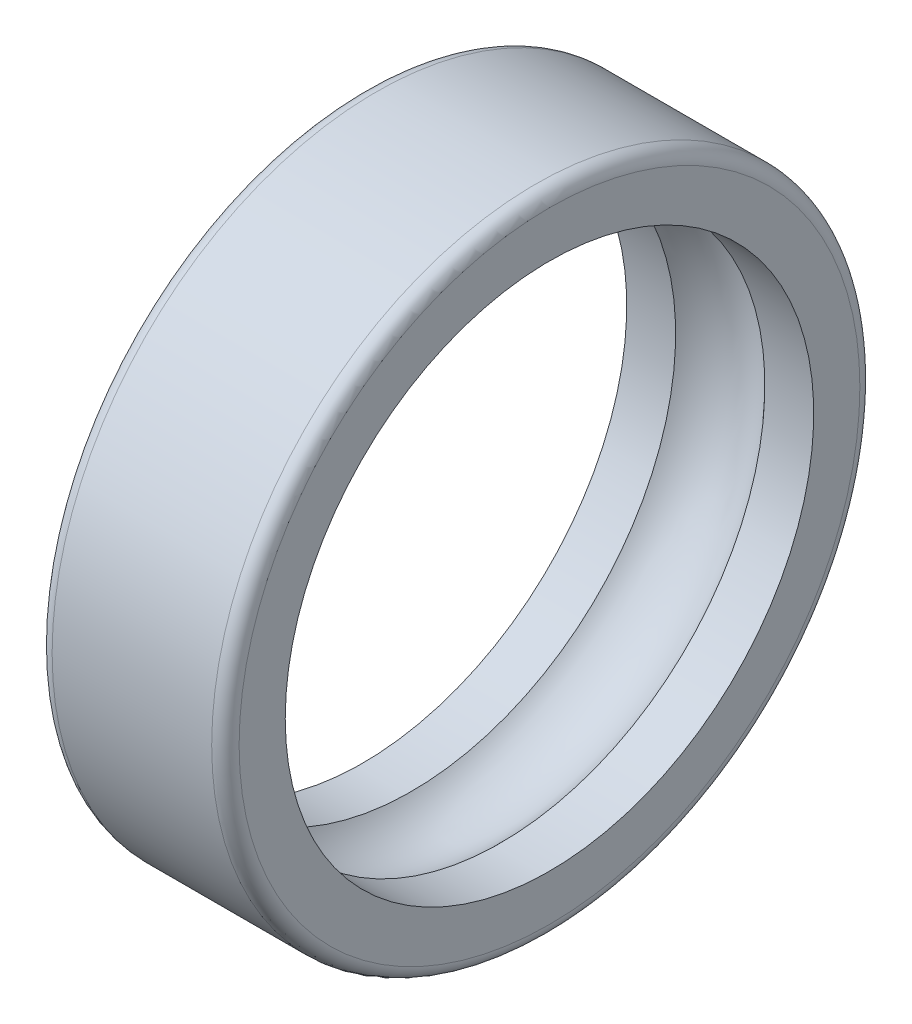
ISO-10303-21;
HEADER;
FILE_DESCRIPTION(('STEP AP214'),'2;1');
FILE_NAME('part.step','',(''),(''),'','','');
FILE_SCHEMA(('AUTOMOTIVE_DESIGN { 1 0 10303 214 1 1 1 1 }'));
ENDSEC;
DATA;
#1=APPLICATION_CONTEXT('core data for automotive mechanical design processes');
#2=APPLICATION_PROTOCOL_DEFINITION('international standard','automotive_design',2000,#1);
#3=PRODUCT_CONTEXT('',#1,'mechanical');
#4=PRODUCT('Part','Part','',(#3));
#5=PRODUCT_RELATED_PRODUCT_CATEGORY('part','',(#4));
#6=PRODUCT_DEFINITION_FORMATION('','',#4);
#7=PRODUCT_DEFINITION_CONTEXT('part definition',#1,'design');
#8=PRODUCT_DEFINITION('design','',#6,#7);
#9=PRODUCT_DEFINITION_SHAPE('','',#8);
#10=(LENGTH_UNIT() NAMED_UNIT(*) SI_UNIT(.MILLI.,.METRE.));
#11=(NAMED_UNIT(*) PLANE_ANGLE_UNIT() SI_UNIT($,.RADIAN.));
#12=(NAMED_UNIT(*) SI_UNIT($,.STERADIAN.) SOLID_ANGLE_UNIT());
#13=UNCERTAINTY_MEASURE_WITH_UNIT(LENGTH_MEASURE(1.E-05),#10,'distance_accuracy_value','');
#14=(GEOMETRIC_REPRESENTATION_CONTEXT(3) GLOBAL_UNCERTAINTY_ASSIGNED_CONTEXT((#13)) GLOBAL_UNIT_ASSIGNED_CONTEXT((#10,
#11,#12)) REPRESENTATION_CONTEXT('',''));
#15=CARTESIAN_POINT('',(0.,0.,0.));
#16=DIRECTION('',(0.,0.,1.));
#17=DIRECTION('',(1.,0.,0.));
#18=AXIS2_PLACEMENT_3D('',#15,#16,#17);
#19=CARTESIAN_POINT('',(1.1,0.,0.));
#20=DIRECTION('',(-1.,0.,0.));
#21=DIRECTION('',(0.,0.,1.));
#22=AXIS2_PLACEMENT_3D('',#19,#20,#21);
#23=TOROIDAL_SURFACE('',#22,24.9,1.1);
#24=CARTESIAN_POINT('',(0.,0.,0.));
#25=DIRECTION('',(-1.,0.,0.));
#26=DIRECTION('',(0.,0.,1.));
#27=AXIS2_PLACEMENT_3D('',#24,#25,#26);
#28=CIRCLE('',#27,24.9);
#29=CARTESIAN_POINT('',(0.,0.,24.9));
#30=VERTEX_POINT('',#29);
#31=EDGE_CURVE('E10',#30,#30,#28,.T.);
#32=ORIENTED_EDGE('',*,*,#31,.F.);
#33=EDGE_LOOP('',(#32));
#34=FACE_BOUND('',#33,.T.);
#35=CARTESIAN_POINT('',(1.1,0.,0.));
#36=DIRECTION('',(-1.,0.,0.));
#37=DIRECTION('',(0.,0.,1.));
#38=AXIS2_PLACEMENT_3D('',#35,#36,#37);
#39=CIRCLE('',#38,26.);
#40=CARTESIAN_POINT('',(1.1,0.,26.));
#41=VERTEX_POINT('',#40);
#42=EDGE_CURVE('E57',#41,#41,#39,.T.);
#43=ORIENTED_EDGE('',*,*,#42,.T.);
#44=EDGE_LOOP('',(#43));
#45=FACE_BOUND('',#44,.T.);
#46=ADVANCED_FACE('F29',(#34,#45),#23,.T.);
#47=CARTESIAN_POINT('',(0.,0.,-24.9));
#48=DIRECTION('',(1.,0.,0.));
#49=DIRECTION('',(0.,0.,-1.));
#50=AXIS2_PLACEMENT_3D('',#47,#48,#49);
#51=PLANE('',#50);
#52=CARTESIAN_POINT('',(0.,0.,0.));
#53=DIRECTION('',(-1.,0.,0.));
#54=DIRECTION('',(0.,0.,1.));
#55=AXIS2_PLACEMENT_3D('',#52,#53,#54);
#56=CIRCLE('',#55,21.2);
#57=CARTESIAN_POINT('',(0.,0.,21.2));
#58=VERTEX_POINT('',#57);
#59=EDGE_CURVE('E35',#58,#58,#56,.T.);
#60=ORIENTED_EDGE('',*,*,#59,.F.);
#61=EDGE_LOOP('',(#60));
#62=FACE_BOUND('',#61,.T.);
#63=ORIENTED_EDGE('',*,*,#31,.T.);
#64=EDGE_LOOP('',(#63));
#65=FACE_BOUND('',#64,.T.);
#66=ADVANCED_FACE('F94',(#62,#65),#51,.F.);
#67=CARTESIAN_POINT('',(0.,0.,0.));
#68=DIRECTION('',(-1.,0.,0.));
#69=DIRECTION('',(0.,0.,1.));
#70=AXIS2_PLACEMENT_3D('',#67,#68,#69);
#71=CYLINDRICAL_SURFACE('',#70,21.2);
#72=CARTESIAN_POINT('',(3.92229123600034,0.,0.));
#73=DIRECTION('',(-1.,0.,0.));
#74=DIRECTION('',(0.,0.,1.));
#75=AXIS2_PLACEMENT_3D('',#72,#73,#74);
#76=CIRCLE('',#75,21.2);
#77=CARTESIAN_POINT('',(3.92229123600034,0.,21.2));
#78=VERTEX_POINT('',#77);
#79=EDGE_CURVE('E39',#78,#78,#76,.T.);
#80=ORIENTED_EDGE('',*,*,#79,.F.);
#81=EDGE_LOOP('',(#80));
#82=FACE_BOUND('',#81,.T.);
#83=ORIENTED_EDGE('',*,*,#59,.T.);
#84=EDGE_LOOP('',(#83));
#85=FACE_BOUND('',#84,.T.);
#86=ADVANCED_FACE('F89',(#82,#85),#71,.F.);
#87=CARTESIAN_POINT('',(7.5,0.,0.));
#88=DIRECTION('',(-1.,0.,0.));
#89=DIRECTION('',(0.,0.,1.));
#90=AXIS2_PLACEMENT_3D('',#87,#88,#89);
#91=TOROIDAL_SURFACE('',#90,18.,4.8);
#92=CARTESIAN_POINT('',(11.0777087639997,0.,0.));
#93=DIRECTION('',(-1.,0.,0.));
#94=DIRECTION('',(0.,0.,1.));
#95=AXIS2_PLACEMENT_3D('',#92,#93,#94);
#96=CIRCLE('',#95,21.2);
#97=CARTESIAN_POINT('',(11.0777087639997,0.,21.2));
#98=VERTEX_POINT('',#97);
#99=EDGE_CURVE('E43',#98,#98,#96,.T.);
#100=ORIENTED_EDGE('',*,*,#99,.F.);
#101=EDGE_LOOP('',(#100));
#102=FACE_BOUND('',#101,.T.);
#103=ORIENTED_EDGE('',*,*,#79,.T.);
#104=EDGE_LOOP('',(#103));
#105=FACE_BOUND('',#104,.T.);
#106=ADVANCED_FACE('F83',(#102,#105),#91,.F.);
#107=CARTESIAN_POINT('',(0.,0.,0.));
#108=DIRECTION('',(-1.,0.,0.));
#109=DIRECTION('',(0.,0.,1.));
#110=AXIS2_PLACEMENT_3D('',#107,#108,#109);
#111=CYLINDRICAL_SURFACE('',#110,21.2);
#112=CARTESIAN_POINT('',(15.,0.,0.));
#113=DIRECTION('',(-1.,0.,0.));
#114=DIRECTION('',(0.,0.,1.));
#115=AXIS2_PLACEMENT_3D('',#112,#113,#114);
#116=CIRCLE('',#115,21.2);
#117=CARTESIAN_POINT('',(15.,0.,21.2));
#118=VERTEX_POINT('',#117);
#119=EDGE_CURVE('E48',#118,#118,#116,.T.);
#120=ORIENTED_EDGE('',*,*,#119,.F.);
#121=EDGE_LOOP('',(#120));
#122=FACE_BOUND('',#121,.T.);
#123=ORIENTED_EDGE('',*,*,#99,.T.);
#124=EDGE_LOOP('',(#123));
#125=FACE_BOUND('',#124,.T.);
#126=ADVANCED_FACE('F77',(#122,#125),#111,.F.);
#127=CARTESIAN_POINT('',(15.,0.,-24.9));
#128=DIRECTION('',(-1.,0.,0.));
#129=DIRECTION('',(0.,0.,1.));
#130=AXIS2_PLACEMENT_3D('',#127,#128,#129);
#131=PLANE('',#130);
#132=CARTESIAN_POINT('',(15.,0.,0.));
#133=DIRECTION('',(-1.,0.,0.));
#134=DIRECTION('',(0.,0.,1.));
#135=AXIS2_PLACEMENT_3D('',#132,#133,#134);
#136=CIRCLE('',#135,24.9);
#137=CARTESIAN_POINT('',(15.,0.,24.9));
#138=VERTEX_POINT('',#137);
#139=EDGE_CURVE('E51',#138,#138,#136,.T.);
#140=ORIENTED_EDGE('',*,*,#139,.F.);
#141=EDGE_LOOP('',(#140));
#142=FACE_BOUND('',#141,.T.);
#143=ORIENTED_EDGE('',*,*,#119,.T.);
#144=EDGE_LOOP('',(#143));
#145=FACE_BOUND('',#144,.T.);
#146=ADVANCED_FACE('F71',(#142,#145),#131,.F.);
#147=CARTESIAN_POINT('',(13.9,0.,0.));
#148=DIRECTION('',(-1.,0.,0.));
#149=DIRECTION('',(0.,0.,1.));
#150=AXIS2_PLACEMENT_3D('',#147,#148,#149);
#151=TOROIDAL_SURFACE('',#150,24.9,1.1);
#152=CARTESIAN_POINT('',(13.9,0.,0.));
#153=DIRECTION('',(-1.,0.,0.));
#154=DIRECTION('',(0.,0.,1.));
#155=AXIS2_PLACEMENT_3D('',#152,#153,#154);
#156=CIRCLE('',#155,26.);
#157=CARTESIAN_POINT('',(13.9,0.,26.));
#158=VERTEX_POINT('',#157);
#159=EDGE_CURVE('E54',#158,#158,#156,.T.);
#160=ORIENTED_EDGE('',*,*,#159,.F.);
#161=EDGE_LOOP('',(#160));
#162=FACE_BOUND('',#161,.T.);
#163=ORIENTED_EDGE('',*,*,#139,.T.);
#164=EDGE_LOOP('',(#163));
#165=FACE_BOUND('',#164,.T.);
#166=ADVANCED_FACE('F65',(#162,#165),#151,.T.);
#167=CARTESIAN_POINT('',(0.,0.,0.));
#168=DIRECTION('',(-1.,0.,0.));
#169=DIRECTION('',(0.,0.,1.));
#170=AXIS2_PLACEMENT_3D('',#167,#168,#169);
#171=CYLINDRICAL_SURFACE('',#170,26.);
#172=ORIENTED_EDGE('',*,*,#42,.F.);
#173=EDGE_LOOP('',(#172));
#174=FACE_BOUND('',#173,.T.);
#175=ORIENTED_EDGE('',*,*,#159,.T.);
#176=EDGE_LOOP('',(#175));
#177=FACE_BOUND('',#176,.T.);
#178=ADVANCED_FACE('F62',(#174,#177),#171,.T.);
#179=CLOSED_SHELL('',(#46,#66,#86,#106,#126,#146,#166,#178));
#180=MANIFOLD_SOLID_BREP('B2',#179);
#181=ADVANCED_BREP_SHAPE_REPRESENTATION('',(#18,#180),#14);
#182=SHAPE_DEFINITION_REPRESENTATION(#9,#181);
ENDSEC;
END-ISO-10303-21;
